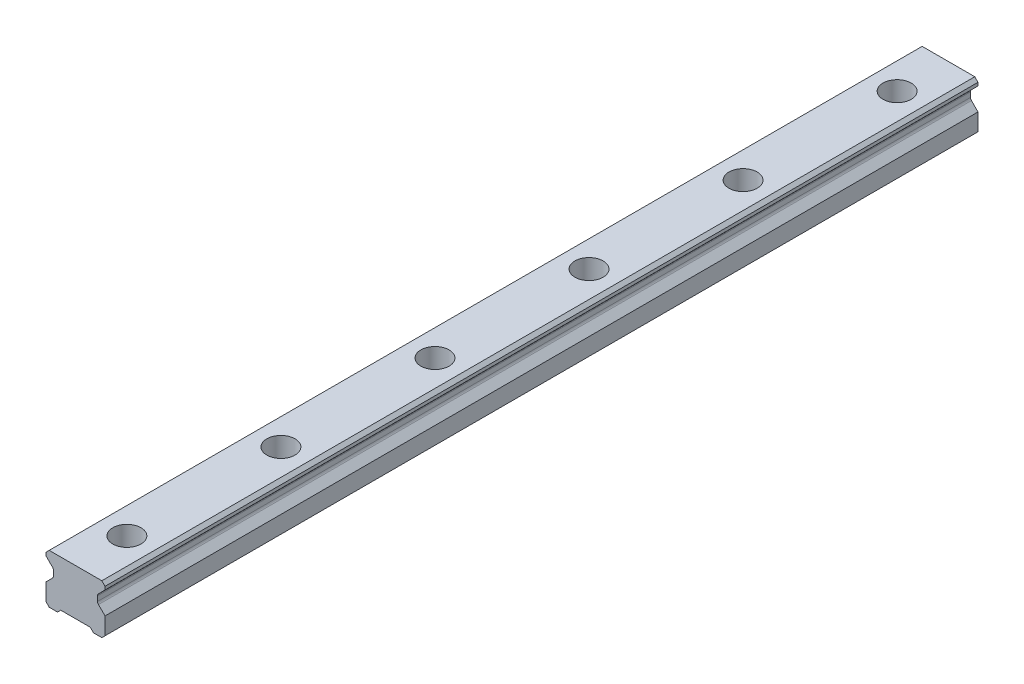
ISO-10303-21;
HEADER;
FILE_DESCRIPTION(('STEP AP214'),'2;1');
FILE_NAME('part.step','',(''),(''),'','','');
FILE_SCHEMA(('AUTOMOTIVE_DESIGN { 1 0 10303 214 1 1 1 1 }'));
ENDSEC;
DATA;
#1=APPLICATION_CONTEXT('core data for automotive mechanical design processes');
#2=APPLICATION_PROTOCOL_DEFINITION('international standard','automotive_design',2000,#1);
#3=PRODUCT_CONTEXT('',#1,'mechanical');
#4=PRODUCT('Part','Part','',(#3));
#5=PRODUCT_RELATED_PRODUCT_CATEGORY('part','',(#4));
#6=PRODUCT_DEFINITION_FORMATION('','',#4);
#7=PRODUCT_DEFINITION_CONTEXT('part definition',#1,'design');
#8=PRODUCT_DEFINITION('design','',#6,#7);
#9=PRODUCT_DEFINITION_SHAPE('','',#8);
#10=(LENGTH_UNIT() NAMED_UNIT(*) SI_UNIT(.MILLI.,.METRE.));
#11=(NAMED_UNIT(*) PLANE_ANGLE_UNIT() SI_UNIT($,.RADIAN.));
#12=(NAMED_UNIT(*) SI_UNIT($,.STERADIAN.) SOLID_ANGLE_UNIT());
#13=UNCERTAINTY_MEASURE_WITH_UNIT(LENGTH_MEASURE(1.E-05),#10,'distance_accuracy_value','');
#14=(GEOMETRIC_REPRESENTATION_CONTEXT(3) GLOBAL_UNCERTAINTY_ASSIGNED_CONTEXT((#13)) GLOBAL_UNIT_ASSIGNED_CONTEXT((#10,
#11,#12)) REPRESENTATION_CONTEXT('',''));
#15=CARTESIAN_POINT('',(0.,0.,0.));
#16=DIRECTION('',(0.,0.,1.));
#17=DIRECTION('',(1.,0.,0.));
#18=AXIS2_PLACEMENT_3D('',#15,#16,#17);
#19=CARTESIAN_POINT('',(0.,10.2,-150.));
#20=DIRECTION('',(0.,1.,0.));
#21=DIRECTION('',(0.,0.,1.));
#22=AXIS2_PLACEMENT_3D('',#19,#20,#21);
#23=PLANE('',#22);
#24=CARTESIAN_POINT('',(0.,10.2,-150.));
#25=DIRECTION('',(0.,1.,0.));
#26=DIRECTION('',(0.,0.,1.));
#27=AXIS2_PLACEMENT_3D('',#24,#25,#26);
#28=CIRCLE('',#27,3.5);
#29=CARTESIAN_POINT('',(0.,10.2,-146.5));
#30=VERTEX_POINT('',#29);
#31=EDGE_CURVE('E390',#30,#30,#28,.T.);
#32=ORIENTED_EDGE('',*,*,#31,.F.);
#33=EDGE_LOOP('',(#32));
#34=FACE_BOUND('',#33,.T.);
#35=CARTESIAN_POINT('',(0.,10.2,-150.));
#36=DIRECTION('',(0.,1.,0.));
#37=DIRECTION('',(0.,0.,1.));
#38=AXIS2_PLACEMENT_3D('',#35,#36,#37);
#39=CIRCLE('',#38,5.5);
#40=CARTESIAN_POINT('',(0.,10.2,-144.5));
#41=VERTEX_POINT('',#40);
#42=EDGE_CURVE('E11',#41,#41,#39,.T.);
#43=ORIENTED_EDGE('',*,*,#42,.T.);
#44=EDGE_LOOP('',(#43));
#45=FACE_BOUND('',#44,.T.);
#46=ADVANCED_FACE('F39',(#34,#45),#23,.T.);
#47=CARTESIAN_POINT('',(0.,10.2,-150.));
#48=DIRECTION('',(0.,1.,0.));
#49=DIRECTION('',(0.,0.,1.));
#50=AXIS2_PLACEMENT_3D('',#47,#48,#49);
#51=CYLINDRICAL_SURFACE('',#50,5.5);
#52=ORIENTED_EDGE('',*,*,#42,.F.);
#53=EDGE_LOOP('',(#52));
#54=FACE_BOUND('',#53,.T.);
#55=CARTESIAN_POINT('',(0.,19.2,-150.));
#56=DIRECTION('',(0.,1.,0.));
#57=DIRECTION('',(0.,0.,1.));
#58=AXIS2_PLACEMENT_3D('',#55,#56,#57);
#59=CIRCLE('',#58,5.5);
#60=CARTESIAN_POINT('',(0.,19.2,-144.5));
#61=VERTEX_POINT('',#60);
#62=EDGE_CURVE('E48',#61,#61,#59,.T.);
#63=ORIENTED_EDGE('',*,*,#62,.T.);
#64=EDGE_LOOP('',(#63));
#65=FACE_BOUND('',#64,.T.);
#66=ADVANCED_FACE('F627',(#54,#65),#51,.F.);
#67=CARTESIAN_POINT('',(0.,10.2,-90.));
#68=DIRECTION('',(0.,1.,0.));
#69=DIRECTION('',(0.,0.,1.));
#70=AXIS2_PLACEMENT_3D('',#67,#68,#69);
#71=PLANE('',#70);
#72=CARTESIAN_POINT('',(0.,10.2,-90.));
#73=DIRECTION('',(0.,1.,0.));
#74=DIRECTION('',(0.,0.,1.));
#75=AXIS2_PLACEMENT_3D('',#72,#73,#74);
#76=CIRCLE('',#75,3.5);
#77=CARTESIAN_POINT('',(0.,10.2,-86.5));
#78=VERTEX_POINT('',#77);
#79=EDGE_CURVE('E394',#78,#78,#76,.T.);
#80=ORIENTED_EDGE('',*,*,#79,.F.);
#81=EDGE_LOOP('',(#80));
#82=FACE_BOUND('',#81,.T.);
#83=CARTESIAN_POINT('',(0.,10.2,-90.));
#84=DIRECTION('',(0.,1.,0.));
#85=DIRECTION('',(0.,0.,1.));
#86=AXIS2_PLACEMENT_3D('',#83,#84,#85);
#87=CIRCLE('',#86,5.5);
#88=CARTESIAN_POINT('',(0.,10.2,-84.5));
#89=VERTEX_POINT('',#88);
#90=EDGE_CURVE('E374',#89,#89,#87,.T.);
#91=ORIENTED_EDGE('',*,*,#90,.T.);
#92=EDGE_LOOP('',(#91));
#93=FACE_BOUND('',#92,.T.);
#94=ADVANCED_FACE('F632',(#82,#93),#71,.T.);
#95=CARTESIAN_POINT('',(0.,10.2,-90.));
#96=DIRECTION('',(0.,1.,0.));
#97=DIRECTION('',(0.,0.,1.));
#98=AXIS2_PLACEMENT_3D('',#95,#96,#97);
#99=CYLINDRICAL_SURFACE('',#98,5.5);
#100=ORIENTED_EDGE('',*,*,#90,.F.);
#101=EDGE_LOOP('',(#100));
#102=FACE_BOUND('',#101,.T.);
#103=CARTESIAN_POINT('',(0.,19.2,-90.));
#104=DIRECTION('',(0.,1.,0.));
#105=DIRECTION('',(0.,0.,1.));
#106=AXIS2_PLACEMENT_3D('',#103,#104,#105);
#107=CIRCLE('',#106,5.5);
#108=CARTESIAN_POINT('',(0.,19.2,-84.5));
#109=VERTEX_POINT('',#108);
#110=EDGE_CURVE('E370',#109,#109,#107,.T.);
#111=ORIENTED_EDGE('',*,*,#110,.T.);
#112=EDGE_LOOP('',(#111));
#113=FACE_BOUND('',#112,.T.);
#114=ADVANCED_FACE('F690',(#102,#113),#99,.F.);
#115=CARTESIAN_POINT('',(0.,10.2,-30.));
#116=DIRECTION('',(0.,1.,0.));
#117=DIRECTION('',(0.,0.,1.));
#118=AXIS2_PLACEMENT_3D('',#115,#116,#117);
#119=PLANE('',#118);
#120=CARTESIAN_POINT('',(0.,10.2,-30.));
#121=DIRECTION('',(0.,1.,0.));
#122=DIRECTION('',(0.,0.,1.));
#123=AXIS2_PLACEMENT_3D('',#120,#121,#122);
#124=CIRCLE('',#123,3.5);
#125=CARTESIAN_POINT('',(0.,10.2,-26.5));
#126=VERTEX_POINT('',#125);
#127=EDGE_CURVE('E398',#126,#126,#124,.T.);
#128=ORIENTED_EDGE('',*,*,#127,.F.);
#129=EDGE_LOOP('',(#128));
#130=FACE_BOUND('',#129,.T.);
#131=CARTESIAN_POINT('',(0.,10.2,-30.));
#132=DIRECTION('',(0.,1.,0.));
#133=DIRECTION('',(0.,0.,1.));
#134=AXIS2_PLACEMENT_3D('',#131,#132,#133);
#135=CIRCLE('',#134,5.5);
#136=CARTESIAN_POINT('',(0.,10.2,-24.5));
#137=VERTEX_POINT('',#136);
#138=EDGE_CURVE('E366',#137,#137,#135,.T.);
#139=ORIENTED_EDGE('',*,*,#138,.T.);
#140=EDGE_LOOP('',(#139));
#141=FACE_BOUND('',#140,.T.);
#142=ADVANCED_FACE('F686',(#130,#141),#119,.T.);
#143=CARTESIAN_POINT('',(0.,10.2,-30.));
#144=DIRECTION('',(0.,1.,0.));
#145=DIRECTION('',(0.,0.,1.));
#146=AXIS2_PLACEMENT_3D('',#143,#144,#145);
#147=CYLINDRICAL_SURFACE('',#146,5.5);
#148=ORIENTED_EDGE('',*,*,#138,.F.);
#149=EDGE_LOOP('',(#148));
#150=FACE_BOUND('',#149,.T.);
#151=CARTESIAN_POINT('',(0.,19.2,-30.));
#152=DIRECTION('',(0.,1.,0.));
#153=DIRECTION('',(0.,0.,1.));
#154=AXIS2_PLACEMENT_3D('',#151,#152,#153);
#155=CIRCLE('',#154,5.5);
#156=CARTESIAN_POINT('',(0.,19.2,-24.5));
#157=VERTEX_POINT('',#156);
#158=EDGE_CURVE('E362',#157,#157,#155,.T.);
#159=ORIENTED_EDGE('',*,*,#158,.T.);
#160=EDGE_LOOP('',(#159));
#161=FACE_BOUND('',#160,.T.);
#162=ADVANCED_FACE('F682',(#150,#161),#147,.F.);
#163=CARTESIAN_POINT('',(0.,10.2,30.));
#164=DIRECTION('',(0.,1.,0.));
#165=DIRECTION('',(0.,0.,1.));
#166=AXIS2_PLACEMENT_3D('',#163,#164,#165);
#167=PLANE('',#166);
#168=CARTESIAN_POINT('',(0.,10.2,30.));
#169=DIRECTION('',(0.,1.,0.));
#170=DIRECTION('',(0.,0.,1.));
#171=AXIS2_PLACEMENT_3D('',#168,#169,#170);
#172=CIRCLE('',#171,3.5);
#173=CARTESIAN_POINT('',(0.,10.2,33.5));
#174=VERTEX_POINT('',#173);
#175=EDGE_CURVE('E414',#174,#174,#172,.T.);
#176=ORIENTED_EDGE('',*,*,#175,.F.);
#177=EDGE_LOOP('',(#176));
#178=FACE_BOUND('',#177,.T.);
#179=CARTESIAN_POINT('',(0.,10.2,30.));
#180=DIRECTION('',(0.,1.,0.));
#181=DIRECTION('',(0.,0.,1.));
#182=AXIS2_PLACEMENT_3D('',#179,#180,#181);
#183=CIRCLE('',#182,5.5);
#184=CARTESIAN_POINT('',(0.,10.2,35.5));
#185=VERTEX_POINT('',#184);
#186=EDGE_CURVE('E358',#185,#185,#183,.T.);
#187=ORIENTED_EDGE('',*,*,#186,.T.);
#188=EDGE_LOOP('',(#187));
#189=FACE_BOUND('',#188,.T.);
#190=ADVANCED_FACE('F678',(#178,#189),#167,.T.);
#191=CARTESIAN_POINT('',(0.,10.2,30.));
#192=DIRECTION('',(0.,1.,0.));
#193=DIRECTION('',(0.,0.,1.));
#194=AXIS2_PLACEMENT_3D('',#191,#192,#193);
#195=CYLINDRICAL_SURFACE('',#194,5.5);
#196=ORIENTED_EDGE('',*,*,#186,.F.);
#197=EDGE_LOOP('',(#196));
#198=FACE_BOUND('',#197,.T.);
#199=CARTESIAN_POINT('',(0.,19.2,30.));
#200=DIRECTION('',(0.,1.,0.));
#201=DIRECTION('',(0.,0.,1.));
#202=AXIS2_PLACEMENT_3D('',#199,#200,#201);
#203=CIRCLE('',#202,5.5);
#204=CARTESIAN_POINT('',(0.,19.2,35.5));
#205=VERTEX_POINT('',#204);
#206=EDGE_CURVE('E355',#205,#205,#203,.T.);
#207=ORIENTED_EDGE('',*,*,#206,.T.);
#208=EDGE_LOOP('',(#207));
#209=FACE_BOUND('',#208,.T.);
#210=ADVANCED_FACE('F675',(#198,#209),#195,.F.);
#211=CARTESIAN_POINT('',(11.5,0.,170.));
#212=DIRECTION('',(0.,1.,0.));
#213=DIRECTION('',(-1.,0.,0.));
#214=AXIS2_PLACEMENT_3D('',#211,#212,#213);
#215=PLANE('',#214);
#216=DIRECTION('',(1.,0.,0.));
#217=VECTOR('',#216,1.);
#218=CARTESIAN_POINT('',(11.5,0.,-170.));
#219=LINE('',#218,#217);
#220=CARTESIAN_POINT('',(-10.2500000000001,0.,-170.));
#221=VERTEX_POINT('',#220);
#222=CARTESIAN_POINT('',(-7.,0.,-170.));
#223=VERTEX_POINT('',#222);
#224=EDGE_CURVE('E229',#221,#223,#219,.T.);
#225=ORIENTED_EDGE('',*,*,#224,.T.);
#226=DIRECTION('',(0.,0.,1.));
#227=VECTOR('',#226,1.);
#228=CARTESIAN_POINT('',(-7.,0.,-170.));
#229=LINE('',#228,#227);
#230=CARTESIAN_POINT('',(-7.,0.,170.));
#231=VERTEX_POINT('',#230);
#232=EDGE_CURVE('E453',#223,#231,#229,.T.);
#233=ORIENTED_EDGE('',*,*,#232,.T.);
#234=DIRECTION('',(1.,0.,0.));
#235=VECTOR('',#234,1.);
#236=CARTESIAN_POINT('',(11.5,0.,170.));
#237=LINE('',#236,#235);
#238=CARTESIAN_POINT('',(-10.2500000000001,0.,170.));
#239=VERTEX_POINT('',#238);
#240=EDGE_CURVE('E522',#239,#231,#237,.T.);
#241=ORIENTED_EDGE('',*,*,#240,.F.);
#242=DIRECTION('',(0.,0.,-1.));
#243=VECTOR('',#242,1.);
#244=CARTESIAN_POINT('',(-10.2500000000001,0.,170.));
#245=LINE('',#244,#243);
#246=EDGE_CURVE('E290',#239,#221,#245,.T.);
#247=ORIENTED_EDGE('',*,*,#246,.T.);
#248=EDGE_LOOP('',(#225,#233,#241,#247));
#249=FACE_BOUND('',#248,.T.);
#250=ADVANCED_FACE('F651',(#249),#215,.F.);
#251=CARTESIAN_POINT('',(-11.5,19.2,170.));
#252=DIRECTION('',(1.,0.,0.));
#253=DIRECTION('',(0.,1.,0.));
#254=AXIS2_PLACEMENT_3D('',#251,#252,#253);
#255=PLANE('',#254);
#256=DIRECTION('',(0.,-1.,0.));
#257=VECTOR('',#256,1.);
#258=CARTESIAN_POINT('',(-11.5,19.2,170.));
#259=LINE('',#258,#257);
#260=CARTESIAN_POINT('',(-11.5,17.95,170.));
#261=VERTEX_POINT('',#260);
#262=CARTESIAN_POINT('',(-11.5,16.7,170.));
#263=VERTEX_POINT('',#262);
#264=EDGE_CURVE('E518',#261,#263,#259,.T.);
#265=ORIENTED_EDGE('',*,*,#264,.F.);
#266=DIRECTION('',(0.,0.,-1.));
#267=VECTOR('',#266,1.);
#268=CARTESIAN_POINT('',(-11.5,17.95,170.));
#269=LINE('',#268,#267);
#270=CARTESIAN_POINT('',(-11.5,17.95,-170.));
#271=VERTEX_POINT('',#270);
#272=EDGE_CURVE('E252',#261,#271,#269,.T.);
#273=ORIENTED_EDGE('',*,*,#272,.T.);
#274=DIRECTION('',(0.,-1.,0.));
#275=VECTOR('',#274,1.);
#276=CARTESIAN_POINT('',(-11.5,19.2,-170.));
#277=LINE('',#276,#275);
#278=CARTESIAN_POINT('',(-11.5,16.7,-170.));
#279=VERTEX_POINT('',#278);
#280=EDGE_CURVE('E230',#271,#279,#277,.T.);
#281=ORIENTED_EDGE('',*,*,#280,.T.);
#282=DIRECTION('',(0.,0.,1.));
#283=VECTOR('',#282,1.);
#284=CARTESIAN_POINT('',(-11.5,16.7,-170.));
#285=LINE('',#284,#283);
#286=EDGE_CURVE('E473',#279,#263,#285,.T.);
#287=ORIENTED_EDGE('',*,*,#286,.T.);
#288=EDGE_LOOP('',(#265,#273,#281,#287));
#289=FACE_BOUND('',#288,.T.);
#290=ADVANCED_FACE('F547',(#289),#255,.F.);
#291=CARTESIAN_POINT('',(11.5,19.2,170.));
#292=DIRECTION('',(-1.,0.,0.));
#293=DIRECTION('',(0.,0.,1.));
#294=AXIS2_PLACEMENT_3D('',#291,#292,#293);
#295=PLANE('',#294);
#296=DIRECTION('',(0.,1.,0.));
#297=VECTOR('',#296,1.);
#298=CARTESIAN_POINT('',(11.5,19.2,170.));
#299=LINE('',#298,#297);
#300=CARTESIAN_POINT('',(11.5,1.25,170.));
#301=VERTEX_POINT('',#300);
#302=CARTESIAN_POINT('',(11.5,7.95,170.));
#303=VERTEX_POINT('',#302);
#304=EDGE_CURVE('E527',#301,#303,#299,.T.);
#305=ORIENTED_EDGE('',*,*,#304,.F.);
#306=DIRECTION('',(0.,0.,-1.));
#307=VECTOR('',#306,1.);
#308=CARTESIAN_POINT('',(11.5,1.25,170.));
#309=LINE('',#308,#307);
#310=CARTESIAN_POINT('',(11.5,1.25,-170.));
#311=VERTEX_POINT('',#310);
#312=EDGE_CURVE('E297',#301,#311,#309,.T.);
#313=ORIENTED_EDGE('',*,*,#312,.T.);
#314=DIRECTION('',(0.,1.,0.));
#315=VECTOR('',#314,1.);
#316=CARTESIAN_POINT('',(11.5,19.2,-170.));
#317=LINE('',#316,#315);
#318=CARTESIAN_POINT('',(11.5,7.95,-170.));
#319=VERTEX_POINT('',#318);
#320=EDGE_CURVE('E243',#311,#319,#317,.T.);
#321=ORIENTED_EDGE('',*,*,#320,.T.);
#322=DIRECTION('',(0.,0.,1.));
#323=VECTOR('',#322,1.);
#324=CARTESIAN_POINT('',(11.5,7.95,-170.));
#325=LINE('',#324,#323);
#326=EDGE_CURVE('E503',#319,#303,#325,.T.);
#327=ORIENTED_EDGE('',*,*,#326,.T.);
#328=EDGE_LOOP('',(#305,#313,#321,#327));
#329=FACE_BOUND('',#328,.T.);
#330=ADVANCED_FACE('F587',(#329),#295,.F.);
#331=CARTESIAN_POINT('',(-11.5,7.95,-170.));
#332=VERTEX_POINT('',#331);
#333=CARTESIAN_POINT('',(-11.5,1.24999999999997,-170.));
#334=VERTEX_POINT('',#333);
#335=EDGE_CURVE('E239',#332,#334,#277,.T.);
#336=ORIENTED_EDGE('',*,*,#335,.T.);
#337=DIRECTION('',(0.,0.,1.));
#338=VECTOR('',#337,1.);
#339=CARTESIAN_POINT('',(-11.5,1.24999999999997,170.));
#340=LINE('',#339,#338);
#341=CARTESIAN_POINT('',(-11.5,1.24999999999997,170.));
#342=VERTEX_POINT('',#341);
#343=EDGE_CURVE('E294',#334,#342,#340,.T.);
#344=ORIENTED_EDGE('',*,*,#343,.T.);
#345=CARTESIAN_POINT('',(-11.5,7.95,170.));
#346=VERTEX_POINT('',#345);
#347=EDGE_CURVE('E251',#346,#342,#259,.T.);
#348=ORIENTED_EDGE('',*,*,#347,.F.);
#349=DIRECTION('',(0.,0.,1.));
#350=VECTOR('',#349,1.);
#351=CARTESIAN_POINT('',(-11.5,7.95,-170.));
#352=LINE('',#351,#350);
#353=EDGE_CURVE('E485',#332,#346,#352,.T.);
#354=ORIENTED_EDGE('',*,*,#353,.F.);
#355=EDGE_LOOP('',(#336,#344,#348,#354));
#356=FACE_BOUND('',#355,.T.);
#357=ADVANCED_FACE('F575',(#356),#255,.F.);
#358=CARTESIAN_POINT('',(7.,0.,170.));
#359=VERTEX_POINT('',#358);
#360=CARTESIAN_POINT('',(10.25,0.,170.));
#361=VERTEX_POINT('',#360);
#362=EDGE_CURVE('E219',#359,#361,#237,.T.);
#363=ORIENTED_EDGE('',*,*,#362,.F.);
#364=DIRECTION('',(0.,0.,1.));
#365=VECTOR('',#364,1.);
#366=CARTESIAN_POINT('',(7.,0.,-170.));
#367=LINE('',#366,#365);
#368=CARTESIAN_POINT('',(7.,0.,-170.));
#369=VERTEX_POINT('',#368);
#370=EDGE_CURVE('E206',#369,#359,#367,.T.);
#371=ORIENTED_EDGE('',*,*,#370,.F.);
#372=CARTESIAN_POINT('',(10.25,0.,-170.));
#373=VERTEX_POINT('',#372);
#374=EDGE_CURVE('E217',#369,#373,#219,.T.);
#375=ORIENTED_EDGE('',*,*,#374,.T.);
#376=DIRECTION('',(0.,0.,1.));
#377=VECTOR('',#376,1.);
#378=CARTESIAN_POINT('',(10.25,0.,170.));
#379=LINE('',#378,#377);
#380=EDGE_CURVE('E287',#373,#361,#379,.T.);
#381=ORIENTED_EDGE('',*,*,#380,.T.);
#382=EDGE_LOOP('',(#363,#371,#375,#381));
#383=FACE_BOUND('',#382,.T.);
#384=ADVANCED_FACE('F215',(#383),#215,.F.);
#385=CARTESIAN_POINT('',(11.5,16.7,-170.));
#386=VERTEX_POINT('',#385);
#387=CARTESIAN_POINT('',(11.5,17.95,-170.));
#388=VERTEX_POINT('',#387);
#389=EDGE_CURVE('E236',#386,#388,#317,.T.);
#390=ORIENTED_EDGE('',*,*,#389,.T.);
#391=DIRECTION('',(0.,0.,1.));
#392=VECTOR('',#391,1.);
#393=CARTESIAN_POINT('',(11.5,17.95,170.));
#394=LINE('',#393,#392);
#395=CARTESIAN_POINT('',(11.5,17.95,170.));
#396=VERTEX_POINT('',#395);
#397=EDGE_CURVE('E301',#388,#396,#394,.T.);
#398=ORIENTED_EDGE('',*,*,#397,.T.);
#399=CARTESIAN_POINT('',(11.5,16.7,170.));
#400=VERTEX_POINT('',#399);
#401=EDGE_CURVE('E526',#400,#396,#299,.T.);
#402=ORIENTED_EDGE('',*,*,#401,.F.);
#403=DIRECTION('',(0.,0.,1.));
#404=VECTOR('',#403,1.);
#405=CARTESIAN_POINT('',(11.5,16.7,-170.));
#406=LINE('',#405,#404);
#407=EDGE_CURVE('E478',#386,#400,#406,.T.);
#408=ORIENTED_EDGE('',*,*,#407,.F.);
#409=EDGE_LOOP('',(#390,#398,#402,#408));
#410=FACE_BOUND('',#409,.T.);
#411=ADVANCED_FACE('F615',(#410),#295,.F.);
#412=CARTESIAN_POINT('',(11.5,19.2,170.));
#413=DIRECTION('',(0.,-1.,0.));
#414=DIRECTION('',(0.,0.,-1.));
#415=AXIS2_PLACEMENT_3D('',#412,#413,#414);
#416=PLANE('',#415);
#417=CARTESIAN_POINT('',(0.,19.2,90.));
#418=DIRECTION('',(0.,1.,0.));
#419=DIRECTION('',(0.,0.,1.));
#420=AXIS2_PLACEMENT_3D('',#417,#418,#419);
#421=CIRCLE('',#420,5.5);
#422=CARTESIAN_POINT('',(0.,19.2,95.5));
#423=VERTEX_POINT('',#422);
#424=EDGE_CURVE('E418',#423,#423,#421,.T.);
#425=ORIENTED_EDGE('',*,*,#424,.F.);
#426=EDGE_LOOP('',(#425));
#427=FACE_BOUND('',#426,.T.);
#428=CARTESIAN_POINT('',(0.,19.2,150.));
#429=DIRECTION('',(0.,1.,0.));
#430=DIRECTION('',(0.,0.,1.));
#431=AXIS2_PLACEMENT_3D('',#428,#429,#430);
#432=CIRCLE('',#431,5.5);
#433=CARTESIAN_POINT('',(0.,19.2,155.5));
#434=VERTEX_POINT('',#433);
#435=EDGE_CURVE('E433',#434,#434,#432,.T.);
#436=ORIENTED_EDGE('',*,*,#435,.F.);
#437=EDGE_LOOP('',(#436));
#438=FACE_BOUND('',#437,.T.);
#439=DIRECTION('',(-1.,0.,0.));
#440=VECTOR('',#439,1.);
#441=CARTESIAN_POINT('',(11.5,19.2,-170.));
#442=LINE('',#441,#440);
#443=CARTESIAN_POINT('',(10.25,19.2,-170.));
#444=VERTEX_POINT('',#443);
#445=CARTESIAN_POINT('',(-10.25,19.2,-170.));
#446=VERTEX_POINT('',#445);
#447=EDGE_CURVE('E247',#444,#446,#442,.T.);
#448=ORIENTED_EDGE('',*,*,#447,.T.);
#449=DIRECTION('',(0.,0.,1.));
#450=VECTOR('',#449,1.);
#451=CARTESIAN_POINT('',(-10.25,19.2,170.));
#452=LINE('',#451,#450);
#453=CARTESIAN_POINT('',(-10.25,19.2,170.));
#454=VERTEX_POINT('',#453);
#455=EDGE_CURVE('E272',#446,#454,#452,.T.);
#456=ORIENTED_EDGE('',*,*,#455,.T.);
#457=DIRECTION('',(-1.,0.,0.));
#458=VECTOR('',#457,1.);
#459=CARTESIAN_POINT('',(11.5,19.2,170.));
#460=LINE('',#459,#458);
#461=CARTESIAN_POINT('',(10.25,19.2,170.));
#462=VERTEX_POINT('',#461);
#463=EDGE_CURVE('E257',#462,#454,#460,.T.);
#464=ORIENTED_EDGE('',*,*,#463,.F.);
#465=DIRECTION('',(0.,0.,-1.));
#466=VECTOR('',#465,1.);
#467=CARTESIAN_POINT('',(10.25,19.2,170.));
#468=LINE('',#467,#466);
#469=EDGE_CURVE('E268',#462,#444,#468,.T.);
#470=ORIENTED_EDGE('',*,*,#469,.T.);
#471=EDGE_LOOP('',(#448,#456,#464,#470));
#472=FACE_BOUND('',#471,.T.);
#473=ORIENTED_EDGE('',*,*,#206,.F.);
#474=EDGE_LOOP('',(#473));
#475=FACE_BOUND('',#474,.T.);
#476=ORIENTED_EDGE('',*,*,#158,.F.);
#477=EDGE_LOOP('',(#476));
#478=FACE_BOUND('',#477,.T.);
#479=ORIENTED_EDGE('',*,*,#110,.F.);
#480=EDGE_LOOP('',(#479));
#481=FACE_BOUND('',#480,.T.);
#482=ORIENTED_EDGE('',*,*,#62,.F.);
#483=EDGE_LOOP('',(#482));
#484=FACE_BOUND('',#483,.T.);
#485=ADVANCED_FACE('F635',(#427,#438,#472,#475,#478,#481,#484),#416,.F.);
#486=CARTESIAN_POINT('',(0.,0.,170.));
#487=DIRECTION('',(0.,0.,-1.));
#488=DIRECTION('',(-1.,0.,0.));
#489=AXIS2_PLACEMENT_3D('',#486,#487,#488);
#490=PLANE('',#489);
#491=ORIENTED_EDGE('',*,*,#240,.T.);
#492=DIRECTION('',(-0.707106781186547,-0.707106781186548,0.));
#493=VECTOR('',#492,1.);
#494=CARTESIAN_POINT('',(-7.,0.,170.));
#495=LINE('',#494,#493);
#496=CARTESIAN_POINT('',(-5.75,1.25,170.));
#497=VERTEX_POINT('',#496);
#498=EDGE_CURVE('E211',#497,#231,#495,.T.);
#499=ORIENTED_EDGE('',*,*,#498,.F.);
#500=DIRECTION('',(-1.,0.,0.));
#501=VECTOR('',#500,1.);
#502=CARTESIAN_POINT('',(-5.75,1.25,170.));
#503=LINE('',#502,#501);
#504=CARTESIAN_POINT('',(5.75,1.25,170.));
#505=VERTEX_POINT('',#504);
#506=EDGE_CURVE('E448',#505,#497,#503,.T.);
#507=ORIENTED_EDGE('',*,*,#506,.F.);
#508=DIRECTION('',(-0.707106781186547,0.707106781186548,0.));
#509=VECTOR('',#508,1.);
#510=CARTESIAN_POINT('',(5.75,1.25,170.));
#511=LINE('',#510,#509);
#512=EDGE_CURVE('E438',#359,#505,#511,.T.);
#513=ORIENTED_EDGE('',*,*,#512,.F.);
#514=ORIENTED_EDGE('',*,*,#362,.T.);
#515=DIRECTION('',(-0.707106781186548,-0.707106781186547,0.));
#516=VECTOR('',#515,1.);
#517=CARTESIAN_POINT('',(11.5,1.25,170.));
#518=LINE('',#517,#516);
#519=EDGE_CURVE('E278',#361,#301,#518,.F.);
#520=ORIENTED_EDGE('',*,*,#519,.T.);
#521=ORIENTED_EDGE('',*,*,#304,.T.);
#522=DIRECTION('',(0.707106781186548,-0.707106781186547,0.));
#523=VECTOR('',#522,1.);
#524=CARTESIAN_POINT('',(11.5,7.95,170.));
#525=LINE('',#524,#523);
#526=CARTESIAN_POINT('',(8.94944985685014,10.5005501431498,170.));
#527=VERTEX_POINT('',#526);
#528=EDGE_CURVE('E457',#527,#303,#525,.T.);
#529=ORIENTED_EDGE('',*,*,#528,.F.);
#530=CARTESIAN_POINT('',(9.83333333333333,11.384433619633,170.));
#531=DIRECTION('',(0.,0.,-1.));
#532=DIRECTION('',(-1.,0.,0.));
#533=AXIS2_PLACEMENT_3D('',#530,#531,#532);
#534=CIRCLE('',#533,1.25);
#535=CARTESIAN_POINT('',(8.58333333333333,11.384433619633,170.));
#536=VERTEX_POINT('',#535);
#537=EDGE_CURVE('E332',#527,#536,#534,.T.);
#538=ORIENTED_EDGE('',*,*,#537,.T.);
#539=DIRECTION('',(0.,-1.,0.));
#540=VECTOR('',#539,1.);
#541=CARTESIAN_POINT('',(8.58333333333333,10.8666666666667,170.));
#542=LINE('',#541,#540);
#543=CARTESIAN_POINT('',(8.58333333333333,13.265566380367,170.));
#544=VERTEX_POINT('',#543);
#545=EDGE_CURVE('E495',#544,#536,#542,.T.);
#546=ORIENTED_EDGE('',*,*,#545,.F.);
#547=CARTESIAN_POINT('',(9.83333333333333,13.265566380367,170.));
#548=DIRECTION('',(0.,0.,-1.));
#549=DIRECTION('',(-1.,0.,0.));
#550=AXIS2_PLACEMENT_3D('',#547,#548,#549);
#551=CIRCLE('',#550,1.25);
#552=CARTESIAN_POINT('',(8.94944985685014,14.1494498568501,170.));
#553=VERTEX_POINT('',#552);
#554=EDGE_CURVE('E338',#544,#553,#551,.T.);
#555=ORIENTED_EDGE('',*,*,#554,.T.);
#556=DIRECTION('',(-0.707106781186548,-0.707106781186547,0.));
#557=VECTOR('',#556,1.);
#558=CARTESIAN_POINT('',(8.58333333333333,13.7833333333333,170.));
#559=LINE('',#558,#557);
#560=EDGE_CURVE('E506',#400,#553,#559,.T.);
#561=ORIENTED_EDGE('',*,*,#560,.F.);
#562=ORIENTED_EDGE('',*,*,#401,.T.);
#563=DIRECTION('',(0.70710678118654,-0.707106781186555,0.));
#564=VECTOR('',#563,1.);
#565=CARTESIAN_POINT('',(10.25,19.2,170.));
#566=LINE('',#565,#564);
#567=EDGE_CURVE('E275',#396,#462,#566,.F.);
#568=ORIENTED_EDGE('',*,*,#567,.T.);
#569=ORIENTED_EDGE('',*,*,#463,.T.);
#570=DIRECTION('',(0.707106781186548,0.707106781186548,0.));
#571=VECTOR('',#570,1.);
#572=CARTESIAN_POINT('',(-11.5,17.95,170.));
#573=LINE('',#572,#571);
#574=EDGE_CURVE('E284',#454,#261,#573,.F.);
#575=ORIENTED_EDGE('',*,*,#574,.T.);
#576=ORIENTED_EDGE('',*,*,#264,.T.);
#577=DIRECTION('',(-0.707106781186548,0.707106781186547,0.));
#578=VECTOR('',#577,1.);
#579=CARTESIAN_POINT('',(-8.58333333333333,13.7833333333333,170.));
#580=LINE('',#579,#578);
#581=CARTESIAN_POINT('',(-8.94944985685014,14.1494498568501,170.));
#582=VERTEX_POINT('',#581);
#583=EDGE_CURVE('E474',#582,#263,#580,.T.);
#584=ORIENTED_EDGE('',*,*,#583,.F.);
#585=CARTESIAN_POINT('',(-9.83333333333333,13.265566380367,170.));
#586=DIRECTION('',(0.,0.,-1.));
#587=DIRECTION('',(-1.,0.,0.));
#588=AXIS2_PLACEMENT_3D('',#585,#586,#587);
#589=CIRCLE('',#588,1.25);
#590=CARTESIAN_POINT('',(-8.58333333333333,13.265566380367,170.));
#591=VERTEX_POINT('',#590);
#592=EDGE_CURVE('E350',#582,#591,#589,.T.);
#593=ORIENTED_EDGE('',*,*,#592,.T.);
#594=DIRECTION('',(0.,1.,0.));
#595=VECTOR('',#594,1.);
#596=CARTESIAN_POINT('',(-8.58333333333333,10.8666666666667,170.));
#597=LINE('',#596,#595);
#598=CARTESIAN_POINT('',(-8.58333333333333,11.384433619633,170.));
#599=VERTEX_POINT('',#598);
#600=EDGE_CURVE('E466',#599,#591,#597,.T.);
#601=ORIENTED_EDGE('',*,*,#600,.F.);
#602=CARTESIAN_POINT('',(-9.83333333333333,11.384433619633,170.));
#603=DIRECTION('',(0.,0.,-1.));
#604=DIRECTION('',(-1.,0.,0.));
#605=AXIS2_PLACEMENT_3D('',#602,#603,#604);
#606=CIRCLE('',#605,1.25);
#607=CARTESIAN_POINT('',(-8.94944985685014,10.5005501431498,170.));
#608=VERTEX_POINT('',#607);
#609=EDGE_CURVE('E344',#599,#608,#606,.T.);
#610=ORIENTED_EDGE('',*,*,#609,.T.);
#611=DIRECTION('',(0.707106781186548,0.707106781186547,0.));
#612=VECTOR('',#611,1.);
#613=CARTESIAN_POINT('',(-11.5,7.95,170.));
#614=LINE('',#613,#612);
#615=EDGE_CURVE('E477',#346,#608,#614,.T.);
#616=ORIENTED_EDGE('',*,*,#615,.F.);
#617=ORIENTED_EDGE('',*,*,#347,.T.);
#618=DIRECTION('',(-0.707106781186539,0.707106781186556,0.));
#619=VECTOR('',#618,1.);
#620=CARTESIAN_POINT('',(-10.2500000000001,0.,170.));
#621=LINE('',#620,#619);
#622=EDGE_CURVE('E281',#342,#239,#621,.F.);
#623=ORIENTED_EDGE('',*,*,#622,.T.);
#624=EDGE_LOOP('',(#491,#499,#507,#513,#514,#520,#521,#529,#538,#546,#555,#561,#562,#568,#569,
#575,#576,#584,#593,#601,#610,#616,#617,#623));
#625=FACE_BOUND('',#624,.T.);
#626=ADVANCED_FACE('F535',(#625),#490,.F.);
#627=CARTESIAN_POINT('',(0.,0.,-170.));
#628=DIRECTION('',(0.,0.,-1.));
#629=DIRECTION('',(-1.,0.,0.));
#630=AXIS2_PLACEMENT_3D('',#627,#628,#629);
#631=PLANE('',#630);
#632=DIRECTION('',(-0.707106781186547,-0.707106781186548,0.));
#633=VECTOR('',#632,1.);
#634=CARTESIAN_POINT('',(-7.,0.,-170.));
#635=LINE('',#634,#633);
#636=CARTESIAN_POINT('',(-5.75,1.25,-170.));
#637=VERTEX_POINT('',#636);
#638=EDGE_CURVE('E221',#637,#223,#635,.T.);
#639=ORIENTED_EDGE('',*,*,#638,.T.);
#640=ORIENTED_EDGE('',*,*,#224,.F.);
#641=DIRECTION('',(0.707106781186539,-0.707106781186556,0.));
#642=VECTOR('',#641,1.);
#643=CARTESIAN_POINT('',(-5.12500000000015,-5.12500000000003,-170.));
#644=LINE('',#643,#642);
#645=EDGE_CURVE('E262',#221,#334,#644,.F.);
#646=ORIENTED_EDGE('',*,*,#645,.T.);
#647=ORIENTED_EDGE('',*,*,#335,.F.);
#648=DIRECTION('',(0.707106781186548,0.707106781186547,0.));
#649=VECTOR('',#648,1.);
#650=CARTESIAN_POINT('',(-11.5,7.95,-170.));
#651=LINE('',#650,#649);
#652=CARTESIAN_POINT('',(-8.94944985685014,10.5005501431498,-170.));
#653=VERTEX_POINT('',#652);
#654=EDGE_CURVE('E465',#332,#653,#651,.T.);
#655=ORIENTED_EDGE('',*,*,#654,.T.);
#656=CARTESIAN_POINT('',(-9.83333333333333,11.384433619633,-170.));
#657=DIRECTION('',(0.,0.,-1.));
#658=DIRECTION('',(-1.,0.,0.));
#659=AXIS2_PLACEMENT_3D('',#656,#657,#658);
#660=CIRCLE('',#659,1.25);
#661=CARTESIAN_POINT('',(-8.58333333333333,11.384433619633,-170.));
#662=VERTEX_POINT('',#661);
#663=EDGE_CURVE('E347',#653,#662,#660,.F.);
#664=ORIENTED_EDGE('',*,*,#663,.T.);
#665=DIRECTION('',(0.,1.,0.));
#666=VECTOR('',#665,1.);
#667=CARTESIAN_POINT('',(-8.58333333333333,10.8666666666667,-170.));
#668=LINE('',#667,#666);
#669=CARTESIAN_POINT('',(-8.58333333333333,13.265566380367,-170.));
#670=VERTEX_POINT('',#669);
#671=EDGE_CURVE('E470',#662,#670,#668,.T.);
#672=ORIENTED_EDGE('',*,*,#671,.T.);
#673=CARTESIAN_POINT('',(-9.83333333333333,13.265566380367,-170.));
#674=DIRECTION('',(0.,0.,-1.));
#675=DIRECTION('',(-1.,0.,0.));
#676=AXIS2_PLACEMENT_3D('',#673,#674,#675);
#677=CIRCLE('',#676,1.25);
#678=CARTESIAN_POINT('',(-8.94944985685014,14.1494498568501,-170.));
#679=VERTEX_POINT('',#678);
#680=EDGE_CURVE('E64',#670,#679,#677,.F.);
#681=ORIENTED_EDGE('',*,*,#680,.T.);
#682=DIRECTION('',(-0.707106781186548,0.707106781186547,0.));
#683=VECTOR('',#682,1.);
#684=CARTESIAN_POINT('',(-8.58333333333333,13.7833333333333,-170.));
#685=LINE('',#684,#683);
#686=EDGE_CURVE('E462',#679,#279,#685,.T.);
#687=ORIENTED_EDGE('',*,*,#686,.T.);
#688=ORIENTED_EDGE('',*,*,#280,.F.);
#689=DIRECTION('',(-0.707106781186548,-0.707106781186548,0.));
#690=VECTOR('',#689,1.);
#691=CARTESIAN_POINT('',(-14.725,14.725,-170.));
#692=LINE('',#691,#690);
#693=EDGE_CURVE('E265',#271,#446,#692,.F.);
#694=ORIENTED_EDGE('',*,*,#693,.T.);
#695=ORIENTED_EDGE('',*,*,#447,.F.);
#696=DIRECTION('',(-0.70710678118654,0.707106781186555,0.));
#697=VECTOR('',#696,1.);
#698=CARTESIAN_POINT('',(14.7250000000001,14.7249999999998,-170.));
#699=LINE('',#698,#697);
#700=EDGE_CURVE('E256',#444,#388,#699,.F.);
#701=ORIENTED_EDGE('',*,*,#700,.T.);
#702=ORIENTED_EDGE('',*,*,#389,.F.);
#703=DIRECTION('',(-0.707106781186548,-0.707106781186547,0.));
#704=VECTOR('',#703,1.);
#705=CARTESIAN_POINT('',(8.58333333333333,13.7833333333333,-170.));
#706=LINE('',#705,#704);
#707=CARTESIAN_POINT('',(8.94944985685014,14.1494498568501,-170.));
#708=VERTEX_POINT('',#707);
#709=EDGE_CURVE('E494',#386,#708,#706,.T.);
#710=ORIENTED_EDGE('',*,*,#709,.T.);
#711=CARTESIAN_POINT('',(9.83333333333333,13.265566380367,-170.));
#712=DIRECTION('',(0.,0.,-1.));
#713=DIRECTION('',(-1.,0.,0.));
#714=AXIS2_PLACEMENT_3D('',#711,#712,#713);
#715=CIRCLE('',#714,1.25);
#716=CARTESIAN_POINT('',(8.58333333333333,13.265566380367,-170.));
#717=VERTEX_POINT('',#716);
#718=EDGE_CURVE('E341',#708,#717,#715,.F.);
#719=ORIENTED_EDGE('',*,*,#718,.T.);
#720=DIRECTION('',(0.,-1.,0.));
#721=VECTOR('',#720,1.);
#722=CARTESIAN_POINT('',(8.58333333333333,10.8666666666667,-170.));
#723=LINE('',#722,#721);
#724=CARTESIAN_POINT('',(8.58333333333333,11.384433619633,-170.));
#725=VERTEX_POINT('',#724);
#726=EDGE_CURVE('E499',#717,#725,#723,.T.);
#727=ORIENTED_EDGE('',*,*,#726,.T.);
#728=CARTESIAN_POINT('',(9.83333333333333,11.384433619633,-170.));
#729=DIRECTION('',(0.,0.,-1.));
#730=DIRECTION('',(-1.,0.,0.));
#731=AXIS2_PLACEMENT_3D('',#728,#729,#730);
#732=CIRCLE('',#731,1.25);
#733=CARTESIAN_POINT('',(8.94944985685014,10.5005501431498,-170.));
#734=VERTEX_POINT('',#733);
#735=EDGE_CURVE('E335',#725,#734,#732,.F.);
#736=ORIENTED_EDGE('',*,*,#735,.T.);
#737=DIRECTION('',(0.707106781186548,-0.707106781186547,0.));
#738=VECTOR('',#737,1.);
#739=CARTESIAN_POINT('',(11.5,7.95,-170.));
#740=LINE('',#739,#738);
#741=EDGE_CURVE('E491',#734,#319,#740,.T.);
#742=ORIENTED_EDGE('',*,*,#741,.T.);
#743=ORIENTED_EDGE('',*,*,#320,.F.);
#744=DIRECTION('',(0.707106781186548,0.707106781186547,0.));
#745=VECTOR('',#744,1.);
#746=CARTESIAN_POINT('',(5.12499999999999,-5.125,-170.));
#747=LINE('',#746,#745);
#748=EDGE_CURVE('E226',#311,#373,#747,.F.);
#749=ORIENTED_EDGE('',*,*,#748,.T.);
#750=ORIENTED_EDGE('',*,*,#374,.F.);
#751=DIRECTION('',(-0.707106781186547,0.707106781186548,0.));
#752=VECTOR('',#751,1.);
#753=CARTESIAN_POINT('',(5.75,1.25,-170.));
#754=LINE('',#753,#752);
#755=CARTESIAN_POINT('',(5.75,1.25,-170.));
#756=VERTEX_POINT('',#755);
#757=EDGE_CURVE('E202',#369,#756,#754,.T.);
#758=ORIENTED_EDGE('',*,*,#757,.T.);
#759=DIRECTION('',(-1.,0.,0.));
#760=VECTOR('',#759,1.);
#761=CARTESIAN_POINT('',(-5.75,1.25,-170.));
#762=LINE('',#761,#760);
#763=EDGE_CURVE('E56',#756,#637,#762,.T.);
#764=ORIENTED_EDGE('',*,*,#763,.T.);
#765=EDGE_LOOP('',(#639,#640,#646,#647,#655,#664,#672,#681,#687,#688,#694,#695,#701,#702,#710,
#719,#727,#736,#742,#743,#749,#750,#758,#764));
#766=FACE_BOUND('',#765,.T.);
#767=ADVANCED_FACE('F224',(#766),#631,.T.);
#768=CARTESIAN_POINT('',(11.5,7.95,-170.));
#769=DIRECTION('',(-0.707106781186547,-0.707106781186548,0.));
#770=DIRECTION('',(0.707106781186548,-0.707106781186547,0.));
#771=AXIS2_PLACEMENT_3D('',#768,#769,#770);
#772=PLANE('',#771);
#773=ORIENTED_EDGE('',*,*,#741,.F.);
#774=DIRECTION('',(0.,0.,1.));
#775=VECTOR('',#774,1.);
#776=CARTESIAN_POINT('',(8.94944985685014,10.5005501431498,170.));
#777=LINE('',#776,#775);
#778=EDGE_CURVE('E304',#734,#527,#777,.T.);
#779=ORIENTED_EDGE('',*,*,#778,.T.);
#780=ORIENTED_EDGE('',*,*,#528,.T.);
#781=ORIENTED_EDGE('',*,*,#326,.F.);
#782=EDGE_LOOP('',(#773,#779,#780,#781));
#783=FACE_BOUND('',#782,.T.);
#784=ADVANCED_FACE('F593',(#783),#772,.F.);
#785=CARTESIAN_POINT('',(8.58333333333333,10.8666666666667,-170.));
#786=DIRECTION('',(-1.,0.,0.));
#787=DIRECTION('',(0.,0.,1.));
#788=AXIS2_PLACEMENT_3D('',#785,#786,#787);
#789=PLANE('',#788);
#790=ORIENTED_EDGE('',*,*,#545,.T.);
#791=DIRECTION('',(0.,0.,1.));
#792=VECTOR('',#791,1.);
#793=CARTESIAN_POINT('',(8.58333333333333,11.384433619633,-170.));
#794=LINE('',#793,#792);
#795=EDGE_CURVE('E312',#536,#725,#794,.F.);
#796=ORIENTED_EDGE('',*,*,#795,.T.);
#797=ORIENTED_EDGE('',*,*,#726,.F.);
#798=DIRECTION('',(0.,0.,1.));
#799=VECTOR('',#798,1.);
#800=CARTESIAN_POINT('',(8.58333333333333,13.265566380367,170.));
#801=LINE('',#800,#799);
#802=EDGE_CURVE('E308',#717,#544,#801,.T.);
#803=ORIENTED_EDGE('',*,*,#802,.T.);
#804=EDGE_LOOP('',(#790,#796,#797,#803));
#805=FACE_BOUND('',#804,.T.);
#806=ADVANCED_FACE('F600',(#805),#789,.F.);
#807=CARTESIAN_POINT('',(8.58333333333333,13.7833333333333,-170.));
#808=DIRECTION('',(-0.707106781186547,0.707106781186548,0.));
#809=DIRECTION('',(-0.707106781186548,-0.707106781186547,0.));
#810=AXIS2_PLACEMENT_3D('',#807,#808,#809);
#811=PLANE('',#810);
#812=ORIENTED_EDGE('',*,*,#560,.T.);
#813=DIRECTION('',(0.,0.,1.));
#814=VECTOR('',#813,1.);
#815=CARTESIAN_POINT('',(8.94944985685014,14.1494498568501,-170.));
#816=LINE('',#815,#814);
#817=EDGE_CURVE('E315',#553,#708,#816,.F.);
#818=ORIENTED_EDGE('',*,*,#817,.T.);
#819=ORIENTED_EDGE('',*,*,#709,.F.);
#820=ORIENTED_EDGE('',*,*,#407,.T.);
#821=EDGE_LOOP('',(#812,#818,#819,#820));
#822=FACE_BOUND('',#821,.T.);
#823=ADVANCED_FACE('F610',(#822),#811,.F.);
#824=CARTESIAN_POINT('',(-8.58333333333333,13.7833333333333,-170.));
#825=DIRECTION('',(0.707106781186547,0.707106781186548,0.));
#826=DIRECTION('',(-0.707106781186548,0.707106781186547,0.));
#827=AXIS2_PLACEMENT_3D('',#824,#825,#826);
#828=PLANE('',#827);
#829=ORIENTED_EDGE('',*,*,#686,.F.);
#830=DIRECTION('',(0.,0.,1.));
#831=VECTOR('',#830,1.);
#832=CARTESIAN_POINT('',(-8.94944985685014,14.1494498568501,170.));
#833=LINE('',#832,#831);
#834=EDGE_CURVE('E328',#679,#582,#833,.T.);
#835=ORIENTED_EDGE('',*,*,#834,.T.);
#836=ORIENTED_EDGE('',*,*,#583,.T.);
#837=ORIENTED_EDGE('',*,*,#286,.F.);
#838=EDGE_LOOP('',(#829,#835,#836,#837));
#839=FACE_BOUND('',#838,.T.);
#840=ADVANCED_FACE('F552',(#839),#828,.F.);
#841=CARTESIAN_POINT('',(-8.58333333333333,10.8666666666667,-170.));
#842=DIRECTION('',(1.,0.,0.));
#843=DIRECTION('',(0.,0.,-1.));
#844=AXIS2_PLACEMENT_3D('',#841,#842,#843);
#845=PLANE('',#844);
#846=ORIENTED_EDGE('',*,*,#671,.F.);
#847=DIRECTION('',(0.,0.,1.));
#848=VECTOR('',#847,1.);
#849=CARTESIAN_POINT('',(-8.58333333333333,11.384433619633,170.));
#850=LINE('',#849,#848);
#851=EDGE_CURVE('E321',#662,#599,#850,.T.);
#852=ORIENTED_EDGE('',*,*,#851,.T.);
#853=ORIENTED_EDGE('',*,*,#600,.T.);
#854=DIRECTION('',(0.,0.,1.));
#855=VECTOR('',#854,1.);
#856=CARTESIAN_POINT('',(-8.58333333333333,13.265566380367,-170.));
#857=LINE('',#856,#855);
#858=EDGE_CURVE('E318',#591,#670,#857,.F.);
#859=ORIENTED_EDGE('',*,*,#858,.T.);
#860=EDGE_LOOP('',(#846,#852,#853,#859));
#861=FACE_BOUND('',#860,.T.);
#862=ADVANCED_FACE('F560',(#861),#845,.F.);
#863=CARTESIAN_POINT('',(-11.5,7.95,-170.));
#864=DIRECTION('',(0.707106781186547,-0.707106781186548,0.));
#865=DIRECTION('',(0.707106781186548,0.707106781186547,0.));
#866=AXIS2_PLACEMENT_3D('',#863,#864,#865);
#867=PLANE('',#866);
#868=ORIENTED_EDGE('',*,*,#615,.T.);
#869=DIRECTION('',(0.,0.,1.));
#870=VECTOR('',#869,1.);
#871=CARTESIAN_POINT('',(-8.94944985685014,10.5005501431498,-170.));
#872=LINE('',#871,#870);
#873=EDGE_CURVE('E325',#608,#653,#872,.F.);
#874=ORIENTED_EDGE('',*,*,#873,.T.);
#875=ORIENTED_EDGE('',*,*,#654,.F.);
#876=ORIENTED_EDGE('',*,*,#353,.T.);
#877=EDGE_LOOP('',(#868,#874,#875,#876));
#878=FACE_BOUND('',#877,.T.);
#879=ADVANCED_FACE('F570',(#878),#867,.F.);
#880=CARTESIAN_POINT('',(-11.5,17.95,170.));
#881=DIRECTION('',(0.707106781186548,-0.707106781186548,0.));
#882=DIRECTION('',(0.,0.,-1.));
#883=AXIS2_PLACEMENT_3D('',#880,#881,#882);
#884=PLANE('',#883);
#885=ORIENTED_EDGE('',*,*,#574,.F.);
#886=ORIENTED_EDGE('',*,*,#455,.F.);
#887=ORIENTED_EDGE('',*,*,#693,.F.);
#888=ORIENTED_EDGE('',*,*,#272,.F.);
#889=EDGE_LOOP('',(#885,#886,#887,#888));
#890=FACE_BOUND('',#889,.T.);
#891=ADVANCED_FACE('F544',(#890),#884,.F.);
#892=CARTESIAN_POINT('',(-10.2500000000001,0.,170.));
#893=DIRECTION('',(0.707106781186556,0.707106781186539,0.));
#894=DIRECTION('',(0.,0.,-1.));
#895=AXIS2_PLACEMENT_3D('',#892,#893,#894);
#896=PLANE('',#895);
#897=ORIENTED_EDGE('',*,*,#622,.F.);
#898=ORIENTED_EDGE('',*,*,#343,.F.);
#899=ORIENTED_EDGE('',*,*,#645,.F.);
#900=ORIENTED_EDGE('',*,*,#246,.F.);
#901=EDGE_LOOP('',(#897,#898,#899,#900));
#902=FACE_BOUND('',#901,.T.);
#903=ADVANCED_FACE('F656',(#902),#896,.F.);
#904=CARTESIAN_POINT('',(11.5,1.25,170.));
#905=DIRECTION('',(-0.707106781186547,0.707106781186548,0.));
#906=DIRECTION('',(0.,0.,-1.));
#907=AXIS2_PLACEMENT_3D('',#904,#905,#906);
#908=PLANE('',#907);
#909=ORIENTED_EDGE('',*,*,#519,.F.);
#910=ORIENTED_EDGE('',*,*,#380,.F.);
#911=ORIENTED_EDGE('',*,*,#748,.F.);
#912=ORIENTED_EDGE('',*,*,#312,.F.);
#913=EDGE_LOOP('',(#909,#910,#911,#912));
#914=FACE_BOUND('',#913,.T.);
#915=ADVANCED_FACE('F585',(#914),#908,.F.);
#916=CARTESIAN_POINT('',(10.25,19.2,170.));
#917=DIRECTION('',(-0.707106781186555,-0.70710678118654,0.));
#918=DIRECTION('',(0.,0.,-1.));
#919=AXIS2_PLACEMENT_3D('',#916,#917,#918);
#920=PLANE('',#919);
#921=ORIENTED_EDGE('',*,*,#567,.F.);
#922=ORIENTED_EDGE('',*,*,#397,.F.);
#923=ORIENTED_EDGE('',*,*,#700,.F.);
#924=ORIENTED_EDGE('',*,*,#469,.F.);
#925=EDGE_LOOP('',(#921,#922,#923,#924));
#926=FACE_BOUND('',#925,.T.);
#927=ADVANCED_FACE('F662',(#926),#920,.F.);
#928=CARTESIAN_POINT('',(9.83333333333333,11.384433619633,-170.));
#929=DIRECTION('',(0.,0.,-1.));
#930=DIRECTION('',(-1.,0.,0.));
#931=AXIS2_PLACEMENT_3D('',#928,#929,#930);
#932=CYLINDRICAL_SURFACE('',#931,1.25);
#933=ORIENTED_EDGE('',*,*,#735,.F.);
#934=ORIENTED_EDGE('',*,*,#795,.F.);
#935=ORIENTED_EDGE('',*,*,#537,.F.);
#936=ORIENTED_EDGE('',*,*,#778,.F.);
#937=EDGE_LOOP('',(#933,#934,#935,#936));
#938=FACE_BOUND('',#937,.T.);
#939=ADVANCED_FACE('F596',(#938),#932,.F.);
#940=CARTESIAN_POINT('',(9.83333333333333,13.265566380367,-170.));
#941=DIRECTION('',(0.,0.,-1.));
#942=DIRECTION('',(-1.,0.,0.));
#943=AXIS2_PLACEMENT_3D('',#940,#941,#942);
#944=CYLINDRICAL_SURFACE('',#943,1.25);
#945=ORIENTED_EDGE('',*,*,#718,.F.);
#946=ORIENTED_EDGE('',*,*,#817,.F.);
#947=ORIENTED_EDGE('',*,*,#554,.F.);
#948=ORIENTED_EDGE('',*,*,#802,.F.);
#949=EDGE_LOOP('',(#945,#946,#947,#948));
#950=FACE_BOUND('',#949,.T.);
#951=ADVANCED_FACE('F605',(#950),#944,.F.);
#952=CARTESIAN_POINT('',(-9.83333333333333,11.384433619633,-170.));
#953=DIRECTION('',(0.,0.,-1.));
#954=DIRECTION('',(-1.,0.,0.));
#955=AXIS2_PLACEMENT_3D('',#952,#953,#954);
#956=CYLINDRICAL_SURFACE('',#955,1.25);
#957=ORIENTED_EDGE('',*,*,#663,.F.);
#958=ORIENTED_EDGE('',*,*,#873,.F.);
#959=ORIENTED_EDGE('',*,*,#609,.F.);
#960=ORIENTED_EDGE('',*,*,#851,.F.);
#961=EDGE_LOOP('',(#957,#958,#959,#960));
#962=FACE_BOUND('',#961,.T.);
#963=ADVANCED_FACE('F564',(#962),#956,.F.);
#964=CARTESIAN_POINT('',(-9.83333333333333,13.265566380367,-170.));
#965=DIRECTION('',(0.,0.,-1.));
#966=DIRECTION('',(-1.,0.,0.));
#967=AXIS2_PLACEMENT_3D('',#964,#965,#966);
#968=CYLINDRICAL_SURFACE('',#967,1.25);
#969=ORIENTED_EDGE('',*,*,#680,.F.);
#970=ORIENTED_EDGE('',*,*,#858,.F.);
#971=ORIENTED_EDGE('',*,*,#592,.F.);
#972=ORIENTED_EDGE('',*,*,#834,.F.);
#973=EDGE_LOOP('',(#969,#970,#971,#972));
#974=FACE_BOUND('',#973,.T.);
#975=ADVANCED_FACE('F555',(#974),#968,.F.);
#976=CARTESIAN_POINT('',(-7.,0.,-170.));
#977=DIRECTION('',(-0.707106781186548,0.707106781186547,0.));
#978=DIRECTION('',(-0.707106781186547,-0.707106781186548,0.));
#979=AXIS2_PLACEMENT_3D('',#976,#977,#978);
#980=PLANE('',#979);
#981=ORIENTED_EDGE('',*,*,#498,.T.);
#982=ORIENTED_EDGE('',*,*,#232,.F.);
#983=ORIENTED_EDGE('',*,*,#638,.F.);
#984=DIRECTION('',(0.,0.,1.));
#985=VECTOR('',#984,1.);
#986=CARTESIAN_POINT('',(-5.75,1.25,-170.));
#987=LINE('',#986,#985);
#988=EDGE_CURVE('E458',#637,#497,#987,.T.);
#989=ORIENTED_EDGE('',*,*,#988,.T.);
#990=EDGE_LOOP('',(#981,#982,#983,#989));
#991=FACE_BOUND('',#990,.T.);
#992=ADVANCED_FACE('F674',(#991),#980,.F.);
#993=CARTESIAN_POINT('',(-5.75,1.25,-170.));
#994=DIRECTION('',(0.,1.,0.));
#995=DIRECTION('',(0.,0.,1.));
#996=AXIS2_PLACEMENT_3D('',#993,#994,#995);
#997=PLANE('',#996);
#998=CARTESIAN_POINT('',(0.,1.25,90.));
#999=DIRECTION('',(0.,1.,0.));
#1000=DIRECTION('',(0.,0.,1.));
#1001=AXIS2_PLACEMENT_3D('',#998,#999,#1000);
#1002=CIRCLE('',#1001,3.5);
#1003=CARTESIAN_POINT('',(0.,1.25,93.5));
#1004=VERTEX_POINT('',#1003);
#1005=EDGE_CURVE('E385',#1004,#1004,#1002,.T.);
#1006=ORIENTED_EDGE('',*,*,#1005,.T.);
#1007=EDGE_LOOP('',(#1006));
#1008=FACE_BOUND('',#1007,.T.);
#1009=CARTESIAN_POINT('',(0.,1.25,30.));
#1010=DIRECTION('',(0.,1.,0.));
#1011=DIRECTION('',(0.,0.,1.));
#1012=AXIS2_PLACEMENT_3D('',#1009,#1010,#1011);
#1013=CIRCLE('',#1012,3.5);
#1014=CARTESIAN_POINT('',(0.,1.25,33.5));
#1015=VERTEX_POINT('',#1014);
#1016=EDGE_CURVE('E42',#1015,#1015,#1013,.T.);
#1017=ORIENTED_EDGE('',*,*,#1016,.T.);
#1018=EDGE_LOOP('',(#1017));
#1019=FACE_BOUND('',#1018,.T.);
#1020=CARTESIAN_POINT('',(0.,1.25,-30.));
#1021=DIRECTION('',(0.,1.,0.));
#1022=DIRECTION('',(0.,0.,1.));
#1023=AXIS2_PLACEMENT_3D('',#1020,#1021,#1022);
#1024=CIRCLE('',#1023,3.5);
#1025=CARTESIAN_POINT('',(0.,1.25,-26.5));
#1026=VERTEX_POINT('',#1025);
#1027=EDGE_CURVE('E395',#1026,#1026,#1024,.T.);
#1028=ORIENTED_EDGE('',*,*,#1027,.T.);
#1029=EDGE_LOOP('',(#1028));
#1030=FACE_BOUND('',#1029,.T.);
#1031=CARTESIAN_POINT('',(0.,1.25,-90.));
#1032=DIRECTION('',(0.,1.,0.));
#1033=DIRECTION('',(0.,0.,1.));
#1034=AXIS2_PLACEMENT_3D('',#1031,#1032,#1033);
#1035=CIRCLE('',#1034,3.5);
#1036=CARTESIAN_POINT('',(0.,1.25,-86.5));
#1037=VERTEX_POINT('',#1036);
#1038=EDGE_CURVE('E391',#1037,#1037,#1035,.T.);
#1039=ORIENTED_EDGE('',*,*,#1038,.T.);
#1040=EDGE_LOOP('',(#1039));
#1041=FACE_BOUND('',#1040,.T.);
#1042=CARTESIAN_POINT('',(0.,1.25,-150.));
#1043=DIRECTION('',(0.,1.,0.));
#1044=DIRECTION('',(0.,0.,1.));
#1045=AXIS2_PLACEMENT_3D('',#1042,#1043,#1044);
#1046=CIRCLE('',#1045,3.5);
#1047=CARTESIAN_POINT('',(0.,1.25,-146.5));
#1048=VERTEX_POINT('',#1047);
#1049=EDGE_CURVE('E386',#1048,#1048,#1046,.T.);
#1050=ORIENTED_EDGE('',*,*,#1049,.T.);
#1051=EDGE_LOOP('',(#1050));
#1052=FACE_BOUND('',#1051,.T.);
#1053=CARTESIAN_POINT('',(0.,1.25,150.));
#1054=DIRECTION('',(0.,1.,0.));
#1055=DIRECTION('',(0.,0.,1.));
#1056=AXIS2_PLACEMENT_3D('',#1053,#1054,#1055);
#1057=CIRCLE('',#1056,3.5);
#1058=CARTESIAN_POINT('',(0.,1.25,153.5));
#1059=VERTEX_POINT('',#1058);
#1060=EDGE_CURVE('E429',#1059,#1059,#1057,.T.);
#1061=ORIENTED_EDGE('',*,*,#1060,.T.);
#1062=EDGE_LOOP('',(#1061));
#1063=FACE_BOUND('',#1062,.T.);
#1064=ORIENTED_EDGE('',*,*,#506,.T.);
#1065=ORIENTED_EDGE('',*,*,#988,.F.);
#1066=ORIENTED_EDGE('',*,*,#763,.F.);
#1067=DIRECTION('',(0.,0.,1.));
#1068=VECTOR('',#1067,1.);
#1069=CARTESIAN_POINT('',(5.75,1.25,-170.));
#1070=LINE('',#1069,#1068);
#1071=EDGE_CURVE('E208',#756,#505,#1070,.T.);
#1072=ORIENTED_EDGE('',*,*,#1071,.T.);
#1073=EDGE_LOOP('',(#1064,#1065,#1066,#1072));
#1074=FACE_BOUND('',#1073,.T.);
#1075=ADVANCED_FACE('F847',(#1008,#1019,#1030,#1041,#1052,#1063,#1074),#997,.F.);
#1076=CARTESIAN_POINT('',(5.75,1.25,-170.));
#1077=DIRECTION('',(0.707106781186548,0.707106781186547,0.));
#1078=DIRECTION('',(-0.707106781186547,0.707106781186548,0.));
#1079=AXIS2_PLACEMENT_3D('',#1076,#1077,#1078);
#1080=PLANE('',#1079);
#1081=ORIENTED_EDGE('',*,*,#512,.T.);
#1082=ORIENTED_EDGE('',*,*,#1071,.F.);
#1083=ORIENTED_EDGE('',*,*,#757,.F.);
#1084=ORIENTED_EDGE('',*,*,#370,.T.);
#1085=EDGE_LOOP('',(#1081,#1082,#1083,#1084));
#1086=FACE_BOUND('',#1085,.T.);
#1087=ADVANCED_FACE('F205',(#1086),#1080,.F.);
#1088=CARTESIAN_POINT('',(0.,10.2,150.));
#1089=DIRECTION('',(0.,1.,0.));
#1090=DIRECTION('',(0.,0.,1.));
#1091=AXIS2_PLACEMENT_3D('',#1088,#1089,#1090);
#1092=CYLINDRICAL_SURFACE('',#1091,5.5);
#1093=CARTESIAN_POINT('',(0.,10.2,150.));
#1094=DIRECTION('',(0.,1.,0.));
#1095=DIRECTION('',(0.,0.,1.));
#1096=AXIS2_PLACEMENT_3D('',#1093,#1094,#1095);
#1097=CIRCLE('',#1096,5.5);
#1098=CARTESIAN_POINT('',(0.,10.2,155.5));
#1099=VERTEX_POINT('',#1098);
#1100=EDGE_CURVE('E434',#1099,#1099,#1097,.T.);
#1101=ORIENTED_EDGE('',*,*,#1100,.F.);
#1102=EDGE_LOOP('',(#1101));
#1103=FACE_BOUND('',#1102,.T.);
#1104=ORIENTED_EDGE('',*,*,#435,.T.);
#1105=EDGE_LOOP('',(#1104));
#1106=FACE_BOUND('',#1105,.T.);
#1107=ADVANCED_FACE('F864',(#1103,#1106),#1092,.F.);
#1108=CARTESIAN_POINT('',(0.,10.2,150.));
#1109=DIRECTION('',(0.,1.,0.));
#1110=DIRECTION('',(0.,0.,1.));
#1111=AXIS2_PLACEMENT_3D('',#1108,#1109,#1110);
#1112=PLANE('',#1111);
#1113=CARTESIAN_POINT('',(0.,10.2,150.));
#1114=DIRECTION('',(0.,1.,0.));
#1115=DIRECTION('',(0.,0.,1.));
#1116=AXIS2_PLACEMENT_3D('',#1113,#1114,#1115);
#1117=CIRCLE('',#1116,3.5);
#1118=CARTESIAN_POINT('',(0.,10.2,153.5));
#1119=VERTEX_POINT('',#1118);
#1120=EDGE_CURVE('E425',#1119,#1119,#1117,.T.);
#1121=ORIENTED_EDGE('',*,*,#1120,.F.);
#1122=EDGE_LOOP('',(#1121));
#1123=FACE_BOUND('',#1122,.T.);
#1124=ORIENTED_EDGE('',*,*,#1100,.T.);
#1125=EDGE_LOOP('',(#1124));
#1126=FACE_BOUND('',#1125,.T.);
#1127=ADVANCED_FACE('F872',(#1123,#1126),#1112,.T.);
#1128=CARTESIAN_POINT('',(0.,0.,150.));
#1129=DIRECTION('',(0.,1.,0.));
#1130=DIRECTION('',(0.,0.,1.));
#1131=AXIS2_PLACEMENT_3D('',#1128,#1129,#1130);
#1132=CYLINDRICAL_SURFACE('',#1131,3.5);
#1133=ORIENTED_EDGE('',*,*,#1120,.T.);
#1134=EDGE_LOOP('',(#1133));
#1135=FACE_BOUND('',#1134,.T.);
#1136=ORIENTED_EDGE('',*,*,#1060,.F.);
#1137=EDGE_LOOP('',(#1136));
#1138=FACE_BOUND('',#1137,.T.);
#1139=ADVANCED_FACE('F881',(#1135,#1138),#1132,.F.);
#1140=CARTESIAN_POINT('',(0.,10.2,90.));
#1141=DIRECTION('',(0.,1.,0.));
#1142=DIRECTION('',(0.,0.,1.));
#1143=AXIS2_PLACEMENT_3D('',#1140,#1141,#1142);
#1144=CYLINDRICAL_SURFACE('',#1143,5.5);
#1145=CARTESIAN_POINT('',(0.,10.2,90.));
#1146=DIRECTION('',(0.,1.,0.));
#1147=DIRECTION('',(0.,0.,1.));
#1148=AXIS2_PLACEMENT_3D('',#1145,#1146,#1147);
#1149=CIRCLE('',#1148,5.5);
#1150=CARTESIAN_POINT('',(0.,10.2,95.5));
#1151=VERTEX_POINT('',#1150);
#1152=EDGE_CURVE('E421',#1151,#1151,#1149,.T.);
#1153=ORIENTED_EDGE('',*,*,#1152,.F.);
#1154=EDGE_LOOP('',(#1153));
#1155=FACE_BOUND('',#1154,.T.);
#1156=ORIENTED_EDGE('',*,*,#424,.T.);
#1157=EDGE_LOOP('',(#1156));
#1158=FACE_BOUND('',#1157,.T.);
#1159=ADVANCED_FACE('F890',(#1155,#1158),#1144,.F.);
#1160=CARTESIAN_POINT('',(0.,10.2,90.));
#1161=DIRECTION('',(0.,1.,0.));
#1162=DIRECTION('',(0.,0.,1.));
#1163=AXIS2_PLACEMENT_3D('',#1160,#1161,#1162);
#1164=PLANE('',#1163);
#1165=CARTESIAN_POINT('',(0.,10.2,90.));
#1166=DIRECTION('',(0.,1.,0.));
#1167=DIRECTION('',(0.,0.,1.));
#1168=AXIS2_PLACEMENT_3D('',#1165,#1166,#1167);
#1169=CIRCLE('',#1168,3.5);
#1170=CARTESIAN_POINT('',(0.,10.2,93.5));
#1171=VERTEX_POINT('',#1170);
#1172=EDGE_CURVE('E381',#1171,#1171,#1169,.T.);
#1173=ORIENTED_EDGE('',*,*,#1172,.F.);
#1174=EDGE_LOOP('',(#1173));
#1175=FACE_BOUND('',#1174,.T.);
#1176=ORIENTED_EDGE('',*,*,#1152,.T.);
#1177=EDGE_LOOP('',(#1176));
#1178=FACE_BOUND('',#1177,.T.);
#1179=ADVANCED_FACE('F899',(#1175,#1178),#1164,.T.);
#1180=CARTESIAN_POINT('',(0.,0.,90.));
#1181=DIRECTION('',(0.,1.,0.));
#1182=DIRECTION('',(0.,0.,1.));
#1183=AXIS2_PLACEMENT_3D('',#1180,#1181,#1182);
#1184=CYLINDRICAL_SURFACE('',#1183,3.5);
#1185=ORIENTED_EDGE('',*,*,#1172,.T.);
#1186=EDGE_LOOP('',(#1185));
#1187=FACE_BOUND('',#1186,.T.);
#1188=ORIENTED_EDGE('',*,*,#1005,.F.);
#1189=EDGE_LOOP('',(#1188));
#1190=FACE_BOUND('',#1189,.T.);
#1191=ADVANCED_FACE('F908',(#1187,#1190),#1184,.F.);
#1192=CARTESIAN_POINT('',(0.,0.,-150.));
#1193=DIRECTION('',(0.,1.,0.));
#1194=DIRECTION('',(0.,0.,1.));
#1195=AXIS2_PLACEMENT_3D('',#1192,#1193,#1194);
#1196=CYLINDRICAL_SURFACE('',#1195,3.5);
#1197=ORIENTED_EDGE('',*,*,#31,.T.);
#1198=EDGE_LOOP('',(#1197));
#1199=FACE_BOUND('',#1198,.T.);
#1200=ORIENTED_EDGE('',*,*,#1049,.F.);
#1201=EDGE_LOOP('',(#1200));
#1202=FACE_BOUND('',#1201,.T.);
#1203=ADVANCED_FACE('F622',(#1199,#1202),#1196,.F.);
#1204=CARTESIAN_POINT('',(0.,0.,-90.));
#1205=DIRECTION('',(0.,1.,0.));
#1206=DIRECTION('',(0.,0.,1.));
#1207=AXIS2_PLACEMENT_3D('',#1204,#1205,#1206);
#1208=CYLINDRICAL_SURFACE('',#1207,3.5);
#1209=ORIENTED_EDGE('',*,*,#79,.T.);
#1210=EDGE_LOOP('',(#1209));
#1211=FACE_BOUND('',#1210,.T.);
#1212=ORIENTED_EDGE('',*,*,#1038,.F.);
#1213=EDGE_LOOP('',(#1212));
#1214=FACE_BOUND('',#1213,.T.);
#1215=ADVANCED_FACE('F925',(#1211,#1214),#1208,.F.);
#1216=CARTESIAN_POINT('',(0.,0.,-30.));
#1217=DIRECTION('',(0.,1.,0.));
#1218=DIRECTION('',(0.,0.,1.));
#1219=AXIS2_PLACEMENT_3D('',#1216,#1217,#1218);
#1220=CYLINDRICAL_SURFACE('',#1219,3.5);
#1221=ORIENTED_EDGE('',*,*,#127,.T.);
#1222=EDGE_LOOP('',(#1221));
#1223=FACE_BOUND('',#1222,.T.);
#1224=ORIENTED_EDGE('',*,*,#1027,.F.);
#1225=EDGE_LOOP('',(#1224));
#1226=FACE_BOUND('',#1225,.T.);
#1227=ADVANCED_FACE('F933',(#1223,#1226),#1220,.F.);
#1228=CARTESIAN_POINT('',(0.,0.,30.));
#1229=DIRECTION('',(0.,1.,0.));
#1230=DIRECTION('',(0.,0.,1.));
#1231=AXIS2_PLACEMENT_3D('',#1228,#1229,#1230);
#1232=CYLINDRICAL_SURFACE('',#1231,3.5);
#1233=ORIENTED_EDGE('',*,*,#175,.T.);
#1234=EDGE_LOOP('',(#1233));
#1235=FACE_BOUND('',#1234,.T.);
#1236=ORIENTED_EDGE('',*,*,#1016,.F.);
#1237=EDGE_LOOP('',(#1236));
#1238=FACE_BOUND('',#1237,.T.);
#1239=ADVANCED_FACE('F941',(#1235,#1238),#1232,.F.);
#1240=CLOSED_SHELL('',(#46,#66,#94,#114,#142,#162,#190,#210,#250,#290,#330,#357,#384,#411,#485,
#626,#767,#784,#806,#823,#840,#862,#879,#891,#903,#915,#927,#939,#951,#963,#975,#992,#1075,
#1087,#1107,#1127,#1139,#1159,#1179,#1191,#1203,#1215,#1227,#1239));
#1241=MANIFOLD_SOLID_BREP('B2',#1240);
#1242=ADVANCED_BREP_SHAPE_REPRESENTATION('',(#18,#1241),#14);
#1243=SHAPE_DEFINITION_REPRESENTATION(#9,#1242);
ENDSEC;
END-ISO-10303-21;
